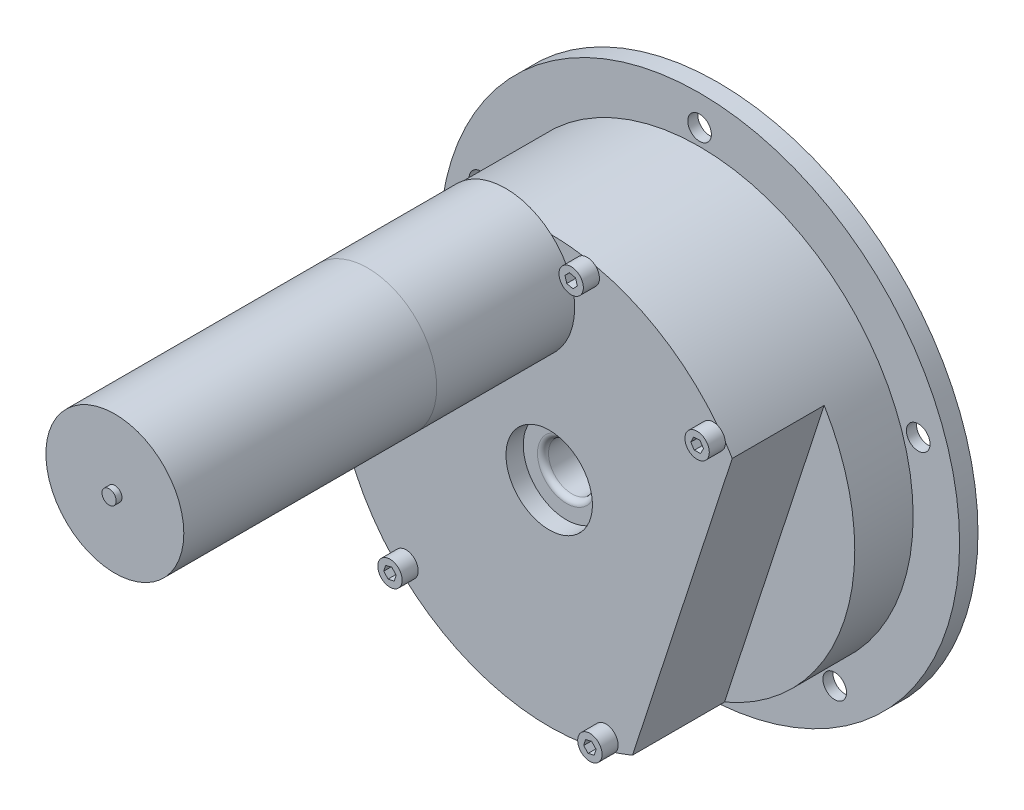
from build123d import *

# Parameters (mm, degrees)
FILLET1_R          = 1.524
SKETCH3_R          = 56.007
EXTRUDE1_DEPTH     = 2.6416
EXTRUDE3_REACH     = 111.729
SKETCH5_R          = 3.2639
CHAMFER1_SIZE      = 3.9878
CHAMFER1_SIZE2     = 2.302357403
EXTRUDE4_DEPTH     = 25.4
SKETCH7_R          = 19.05
EXTRUDE5_DEPTH     = 107.95
SKETCH9_R          = 3.3655
EXTRUDE6_DEPTH     = 4.445
SKETCH10_R         = 1.9685
EXTRUDE7_DEPTH     = 24.765
CUT_EXTRUDE1_START = 1.5875
SKETCH15_R         = 1.9685
CUT_EXTRUDE1_DEPTH = 184.356487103


with BuildPart() as part:
    # Sketch2 → Revolve1 (revolve)
    with BuildSketch(Plane(origin=(0, 0, 0), x_dir=(0, 0, -1), z_dir=(1, 0, 0)), mode=Mode.PRIVATE) as revolve1_sk:
        Polygon((0, 6.477), (0, 71.8185), (-5.08, 71.8185), (-5.08, 58.9915), (-46.609, 58.9915), (-46.609, 11.938), (-41.8465, 11.938), (-41.8465, 6.477), align=None)
    revolve(revolve1_sk.sketch.rotate(Axis((0, 0, 46.609), (0, 0, -1)), 90), axis=Axis((0, 0, 46.609), (0, 0, -1)))

    # Fillet1
    fillet1_edges = [part.edges().sort_by_distance(p)[0] for p in [
        (-6.477, 0, 41.8465),
    ]]
    fillet(fillet1_edges, radius=FILLET1_R)

    # Sketch3 → Extrude1 (cut)
    with BuildSketch(Plane(origin=(0, 0, 0), x_dir=(-1, 0, 0), z_dir=(0, 0, -1))):
        Circle(SKETCH3_R)
    extrude(amount=-EXTRUDE1_DEPTH, mode=Mode.SUBTRACT)

    # Sketch5 → Extrude3 (cut, up to next)
    with BuildSketch(Plane.XY.offset(5.08), mode=Mode.PRIVATE) as extrude3_sk1:
        with Locations((0, 63.5)):
            Circle(SKETCH5_R)
    extrude3_tool1 = extrude(extrude3_sk1.sketch, amount=-EXTRUDE3_REACH, mode=Mode.PRIVATE) & part.part
    # Sketch5 → Extrude3 (cut, up to next)
    with BuildSketch(Plane.XY.offset(5.08), mode=Mode.PRIVATE) as extrude3_sk2:
        with Locations((60.392088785, 19.622579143)):
            Circle(SKETCH5_R)
    extrude3_tool2 = extrude(extrude3_sk2.sketch, amount=-EXTRUDE3_REACH, mode=Mode.PRIVATE) & part.part
    # Sketch5 → Extrude3 (cut, up to next)
    with BuildSketch(Plane.XY.offset(5.08), mode=Mode.PRIVATE) as extrude3_sk3:
        with Locations((37.324363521, -51.372579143)):
            Circle(SKETCH5_R)
    extrude3_tool3 = extrude(extrude3_sk3.sketch, amount=-EXTRUDE3_REACH, mode=Mode.PRIVATE) & part.part
    # Sketch5 → Extrude3 (cut, up to next)
    with BuildSketch(Plane.XY.offset(5.08), mode=Mode.PRIVATE) as extrude3_sk4:
        with Locations((-37.324363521, -51.372579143)):
            Circle(SKETCH5_R)
    extrude3_tool4 = extrude(extrude3_sk4.sketch, amount=-EXTRUDE3_REACH, mode=Mode.PRIVATE) & part.part
    # Sketch5 → Extrude3 (cut, up to next)
    with BuildSketch(Plane.XY.offset(5.08), mode=Mode.PRIVATE) as extrude3_sk5:
        with Locations((-60.392088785, 19.622579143)):
            Circle(SKETCH5_R)
    extrude3_tool5 = extrude(extrude3_sk5.sketch, amount=-EXTRUDE3_REACH, mode=Mode.PRIVATE) & part.part
    add(extrude3_tool1.solids().sort_by_distance((0, 63.5, 5.08))[0], mode=Mode.SUBTRACT)
    add(extrude3_tool2.solids().sort_by_distance((60.392089, 19.622579, 5.08))[0], mode=Mode.SUBTRACT)
    add(extrude3_tool3.solids().sort_by_distance((37.324364, -51.372579, 5.08))[0], mode=Mode.SUBTRACT)
    add(extrude3_tool4.solids().sort_by_distance((-37.324364, -51.372579, 5.08))[0], mode=Mode.SUBTRACT)
    add(extrude3_tool5.solids().sort_by_distance((-60.392089, 19.622579, 5.08))[0], mode=Mode.SUBTRACT)

    # Chamfer1
    chamfer1_edges = [part.edges().sort_by_distance(p)[0] for p in [
        (-3.2639, 63.5, 0),
        (57.128188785, 19.622579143, 0),
        (34.060463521, -51.372579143, 0),
        (-40.588263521, -51.372579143, 0),
        (-63.655988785, 19.622579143, 0),
    ]]
    chamfer1_side = [part.faces().sort_by_distance(p)[0] for p in [
        (-69.787166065, 0, 0),
    ]]
    chamfer(chamfer1_edges, length=CHAMFER1_SIZE, length2=CHAMFER1_SIZE2, reference=chamfer1_side[0])

    # Sketch6 → Extrude4 (cut)
    with BuildSketch(Plane.XY.offset(46.609)):
        Polygon((50.54556585, 30.416160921), (23.014050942, -54.317129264), (47.170886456, -62.166160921), (74.702401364, 22.567129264), align=None)
    extrude(amount=-EXTRUDE4_DEPTH, mode=Mode.SUBTRACT)

    # Sketch7 → Extrude5 (add)
    with BuildSketch(Plane.XY.offset(46.609)):
        with Locations(Location((-12.023794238, 44.70269952, 0), (0, 0, 161.525972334))):
            Circle(SKETCH7_R)
    extrude(amount=EXTRUDE5_DEPTH)

    # Sketch9 → Extrude6 (add)
    # profile 1 of 5: a face of its own
    with BuildSketch(Plane.XY.offset(46.609)):
        with Locations(Location((45.289737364, 33.164222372, 0), (0, 0, 69.001086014))):
            Circle(SKETCH9_R)
        Polygon((46.260636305, 31.696529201), (47.046246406, 33.271198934), (46.075347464, 34.738892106), (44.318838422, 34.631915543), (43.533228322, 33.057245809), (44.504127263, 31.589552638), align=None, mode=Mode.SUBTRACT)
    # profile 2 of 5: a face of its own
    with BuildSketch(Plane.XY.offset(46.609)):
        with Locations(Location((10.504871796, 55.142303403, 0), (0, 0, 112.001086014))):
            Circle(SKETCH9_R)
        Polygon((12.215906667, 54.731052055), (11.716543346, 56.418477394), (10.005508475, 56.829728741), (8.793836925, 55.55355475), (9.293200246, 53.866129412), (11.004235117, 53.454878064), align=None, mode=Mode.SUBTRACT)
    # profile 3 of 5: a face of its own
    with BuildSketch(Plane.XY.offset(46.609)):
        with Locations(Location((15.674172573, -53.901264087, 0), (0, 0, 253.427158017))):
            Circle(SKETCH9_R)
        Polygon((13.962925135, -54.311630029), (15.173936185, -55.588430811), (16.885183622, -55.178064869), (17.38542001, -53.490898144), (16.174408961, -52.214097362), (14.463161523, -52.624463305), align=None, mode=Mode.SUBTRACT)
    # profile 4 of 5: a face of its own
    with BuildSketch(Plane.XY.offset(46.609)):
        with Locations(Location((-56.011502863, 3.706413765, 0), (0, 0, 209.001086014))):
            Circle(SKETCH9_R)
        Polygon((-55.811839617, 5.454813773), (-57.425830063, 4.753527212), (-57.625493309, 3.005127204), (-56.211166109, 1.958013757), (-54.597175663, 2.659300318), (-54.397512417, 4.407700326), align=None, mode=Mode.SUBTRACT)
    # profile 5 of 5: a face of its own
    with BuildSketch(Plane.XY.offset(46.609)):
        with Locations(Location((-39.544118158, -39.840791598, 0), (0, 0, 192.427158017))):
            Circle(SKETCH9_R)
        Polygon((-40.732661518, -38.543050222), (-41.262266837, -40.221229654), (-40.073723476, -41.51897103), (-38.355574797, -41.138532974), (-37.825969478, -39.460353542), (-39.014512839, -38.162612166), align=None, mode=Mode.SUBTRACT)
    extrude(amount=EXTRUDE6_DEPTH)

    # Sketch10 → Extrude7 (add)
    with BuildSketch(Plane.XY.offset(154.559)):
        with Locations((-12.023794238, 44.70269952)):
            Circle(SKETCH10_R)
    extrude(amount=EXTRUDE7_DEPTH)

    # Sketch15 → Cut-Extrude1 (cut, through all)
    with BuildSketch(Plane.XY.offset(154.559).offset(CUT_EXTRUDE1_START)):
        with Locations((-12.023794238, 44.70269952)):
            Circle(SKETCH15_R)
    extrude(amount=CUT_EXTRUDE1_DEPTH, mode=Mode.SUBTRACT)


solid = part.part
